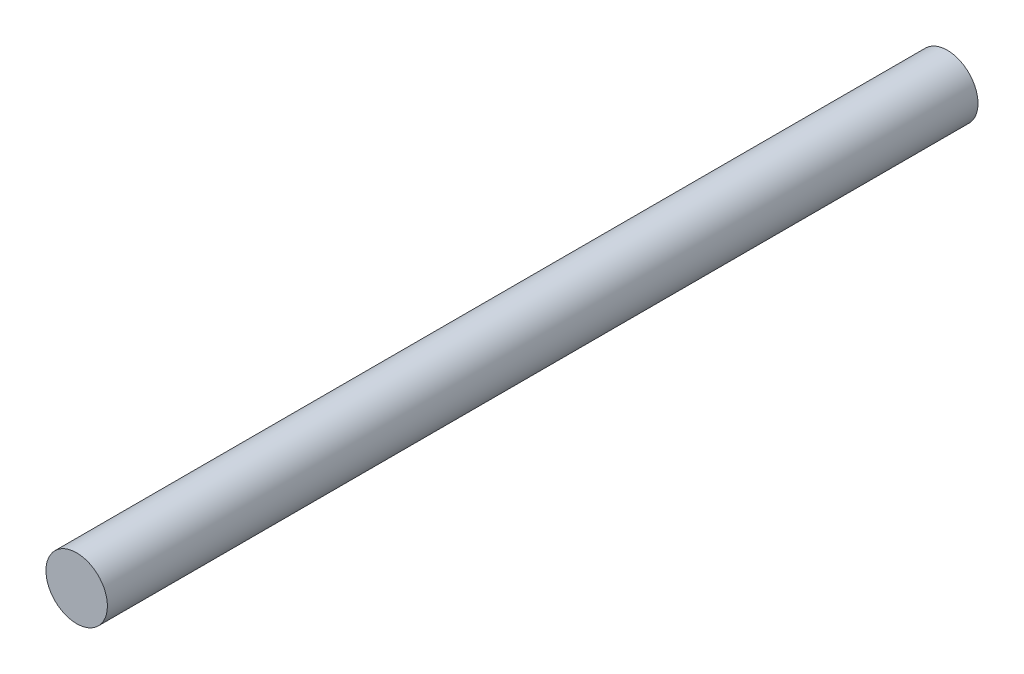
from build123d import *

# Parameters (mm, degrees)
SKETCH1_R           = 30
BOSS_EXTRUDE1_DEPTH = 850


with BuildPart() as part:
    # Sketch1 → Boss-Extrude1 (new body)
    with BuildSketch(Plane.XY):
        Circle(SKETCH1_R)
    extrude(amount=-BOSS_EXTRUDE1_DEPTH)


solid = part.part
